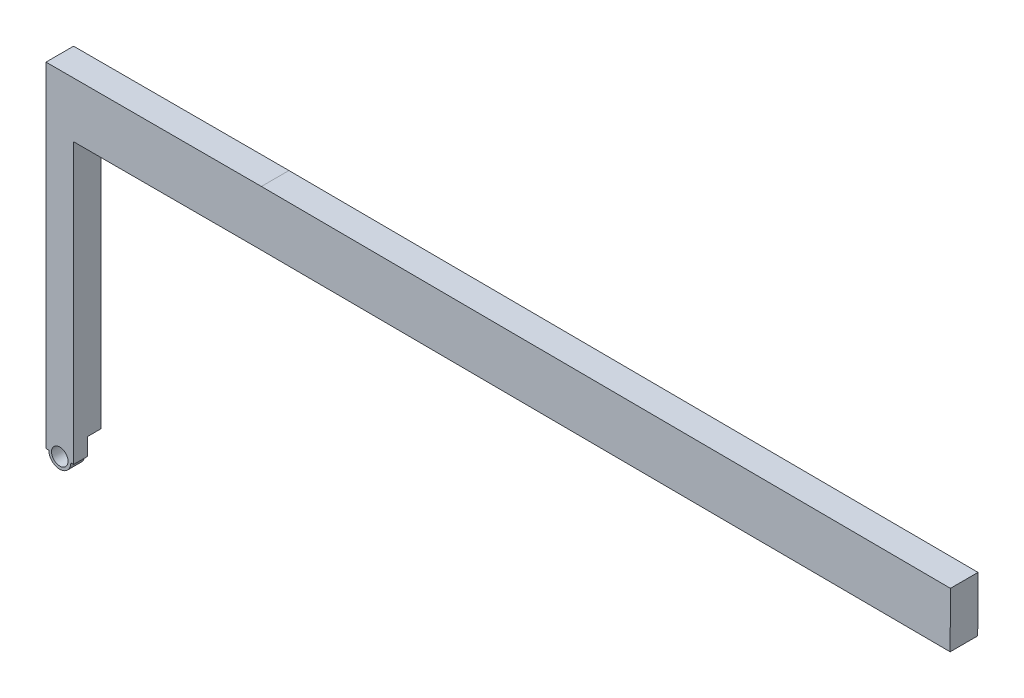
ISO-10303-21;
HEADER;
FILE_DESCRIPTION(('STEP AP214'),'2;1');
FILE_NAME('part.step','',(''),(''),'','','');
FILE_SCHEMA(('AUTOMOTIVE_DESIGN { 1 0 10303 214 1 1 1 1 }'));
ENDSEC;
DATA;
#1=APPLICATION_CONTEXT('core data for automotive mechanical design processes');
#2=APPLICATION_PROTOCOL_DEFINITION('international standard','automotive_design',2000,#1);
#3=PRODUCT_CONTEXT('',#1,'mechanical');
#4=PRODUCT('Part','Part','',(#3));
#5=PRODUCT_RELATED_PRODUCT_CATEGORY('part','',(#4));
#6=PRODUCT_DEFINITION_FORMATION('','',#4);
#7=PRODUCT_DEFINITION_CONTEXT('part definition',#1,'design');
#8=PRODUCT_DEFINITION('design','',#6,#7);
#9=PRODUCT_DEFINITION_SHAPE('','',#8);
#10=(LENGTH_UNIT() NAMED_UNIT(*) SI_UNIT(.MILLI.,.METRE.));
#11=(NAMED_UNIT(*) PLANE_ANGLE_UNIT() SI_UNIT($,.RADIAN.));
#12=(NAMED_UNIT(*) SI_UNIT($,.STERADIAN.) SOLID_ANGLE_UNIT());
#13=UNCERTAINTY_MEASURE_WITH_UNIT(LENGTH_MEASURE(1.E-05),#10,'distance_accuracy_value','');
#14=(GEOMETRIC_REPRESENTATION_CONTEXT(3) GLOBAL_UNCERTAINTY_ASSIGNED_CONTEXT((#13)) GLOBAL_UNIT_ASSIGNED_CONTEXT((#10,
#11,#12)) REPRESENTATION_CONTEXT('',''));
#15=CARTESIAN_POINT('',(0.,0.,0.));
#16=DIRECTION('',(0.,0.,1.));
#17=DIRECTION('',(1.,0.,0.));
#18=AXIS2_PLACEMENT_3D('',#15,#16,#17);
#19=CARTESIAN_POINT('',(0.,15.922114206,1.27));
#20=DIRECTION('',(0.,1.,0.));
#21=DIRECTION('',(0.,0.,1.));
#22=AXIS2_PLACEMENT_3D('',#19,#20,#21);
#23=PLANE('',#22);
#24=DIRECTION('',(1.,0.,0.));
#25=VECTOR('',#24,1.);
#26=CARTESIAN_POINT('',(0.,15.922114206,0.));
#27=LINE('',#26,#25);
#28=CARTESIAN_POINT('',(-1.27,15.922114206,0.));
#29=VERTEX_POINT('',#28);
#30=CARTESIAN_POINT('',(8.64892992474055,15.922114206,0.));
#31=VERTEX_POINT('',#30);
#32=EDGE_CURVE('E190',#29,#31,#27,.T.);
#33=ORIENTED_EDGE('',*,*,#32,.F.);
#34=DIRECTION('',(0.,0.,-1.));
#35=VECTOR('',#34,1.);
#36=CARTESIAN_POINT('',(-1.27,15.922114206,60.10272807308));
#37=LINE('',#36,#35);
#38=CARTESIAN_POINT('',(-1.27,15.922114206,1.27));
#39=VERTEX_POINT('',#38);
#40=EDGE_CURVE('E54',#39,#29,#37,.T.);
#41=ORIENTED_EDGE('',*,*,#40,.F.);
#42=DIRECTION('',(1.,0.,0.));
#43=VECTOR('',#42,1.);
#44=CARTESIAN_POINT('',(0.,15.922114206,1.27));
#45=LINE('',#44,#43);
#46=CARTESIAN_POINT('',(8.64892992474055,15.922114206,1.27));
#47=VERTEX_POINT('',#46);
#48=EDGE_CURVE('E143',#39,#47,#45,.T.);
#49=ORIENTED_EDGE('',*,*,#48,.T.);
#50=DIRECTION('',(0.,0.,-1.));
#51=VECTOR('',#50,1.);
#52=CARTESIAN_POINT('',(8.64892992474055,15.922114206,1.27));
#53=LINE('',#52,#51);
#54=EDGE_CURVE('E203',#47,#31,#53,.T.);
#55=ORIENTED_EDGE('',*,*,#54,.T.);
#56=EDGE_LOOP('',(#33,#41,#49,#55));
#57=FACE_BOUND('',#56,.T.);
#58=ADVANCED_FACE('F31',(#57),#23,.T.);
#59=CARTESIAN_POINT('',(24.5049692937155,13.3012355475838,1.27));
#60=DIRECTION('',(0.,0.,1.));
#61=DIRECTION('',(1.,0.,0.));
#62=AXIS2_PLACEMENT_3D('',#59,#60,#61);
#63=PLANE('',#62);
#64=DIRECTION('',(-1.,0.,0.));
#65=VECTOR('',#64,1.);
#66=CARTESIAN_POINT('',(24.5049692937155,0.508,1.27));
#67=LINE('',#66,#65);
#68=CARTESIAN_POINT('',(0.,0.508,1.27));
#69=VERTEX_POINT('',#68);
#70=CARTESIAN_POINT('',(-0.127,0.508,1.27));
#71=VERTEX_POINT('',#70);
#72=EDGE_CURVE('E232',#69,#71,#67,.T.);
#73=ORIENTED_EDGE('',*,*,#72,.F.);
#74=DIRECTION('',(0.,1.,0.));
#75=VECTOR('',#74,1.);
#76=CARTESIAN_POINT('',(0.,0.,1.27));
#77=LINE('',#76,#75);
#78=CARTESIAN_POINT('',(0.,13.382114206,1.27));
#79=VERTEX_POINT('',#78);
#80=EDGE_CURVE('E173',#69,#79,#77,.T.);
#81=ORIENTED_EDGE('',*,*,#80,.T.);
#82=DIRECTION('',(1.,0.,0.));
#83=VECTOR('',#82,1.);
#84=CARTESIAN_POINT('',(0.,13.382114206,1.27));
#85=LINE('',#84,#83);
#86=CARTESIAN_POINT('',(8.64245458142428,13.382114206,1.27));
#87=VERTEX_POINT('',#86);
#88=EDGE_CURVE('E175',#79,#87,#85,.T.);
#89=ORIENTED_EDGE('',*,*,#88,.T.);
#90=CARTESIAN_POINT('',(8.64245458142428,13.382114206,1.27));
#91=CARTESIAN_POINT('',(19.2174643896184,13.3281951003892,1.27));
#92=CARTESIAN_POINT('',(29.7924741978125,13.2742759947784,1.27));
#93=CARTESIAN_POINT('',(40.3674840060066,13.2203568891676,1.27));
#94=B_SPLINE_CURVE_WITH_KNOTS('',3,(#90,#91,#92,#93),.UNSPECIFIED.,.F.,.F.,(4,4),(0.,1.),.UNSPECIFIED.);
#95=CARTESIAN_POINT('',(40.3674840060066,13.2203568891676,1.27));
#96=VERTEX_POINT('',#95);
#97=EDGE_CURVE('E153',#87,#96,#94,.T.);
#98=ORIENTED_EDGE('',*,*,#97,.T.);
#99=DIRECTION('',(-0.0050986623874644,-0.999987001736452,0.));
#100=VECTOR('',#99,1.);
#101=CARTESIAN_POINT('',(40.3804346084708,15.7603238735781,1.27));
#102=LINE('',#101,#100);
#103=CARTESIAN_POINT('',(40.3804346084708,15.7603238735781,1.27));
#104=VERTEX_POINT('',#103);
#105=EDGE_CURVE('E157',#104,#96,#102,.T.);
#106=ORIENTED_EDGE('',*,*,#105,.F.);
#107=CARTESIAN_POINT('',(8.64892992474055,15.922114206,1.27));
#108=CARTESIAN_POINT('',(40.3804346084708,15.7603238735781,1.27));
#109=B_SPLINE_CURVE_WITH_KNOTS('',1,(#107,#108),.UNSPECIFIED.,.F.,.F.,(2,2),(0.,1.),.UNSPECIFIED.);
#110=EDGE_CURVE('E164',#47,#104,#109,.T.);
#111=ORIENTED_EDGE('',*,*,#110,.F.);
#112=ORIENTED_EDGE('',*,*,#48,.F.);
#113=DIRECTION('',(0.,-1.,0.));
#114=VECTOR('',#113,1.);
#115=CARTESIAN_POINT('',(-1.27,13.3012355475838,1.27));
#116=LINE('',#115,#114);
#117=CARTESIAN_POINT('',(-1.27,0.508,1.27000000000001));
#118=VERTEX_POINT('',#117);
#119=EDGE_CURVE('E134',#39,#118,#116,.T.);
#120=ORIENTED_EDGE('',*,*,#119,.T.);
#121=DIRECTION('',(-1.,0.,0.));
#122=VECTOR('',#121,1.);
#123=CARTESIAN_POINT('',(24.5049692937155,0.508,1.27));
#124=LINE('',#123,#122);
#125=CARTESIAN_POINT('',(-1.143,0.508,1.27));
#126=VERTEX_POINT('',#125);
#127=EDGE_CURVE('E120',#126,#118,#124,.T.);
#128=ORIENTED_EDGE('',*,*,#127,.F.);
#129=CARTESIAN_POINT('',(-0.635,0.508,1.27));
#130=DIRECTION('',(0.,0.,1.));
#131=DIRECTION('',(1.,0.,0.));
#132=AXIS2_PLACEMENT_3D('',#129,#130,#131);
#133=CIRCLE('',#132,0.508);
#134=EDGE_CURVE('E127',#71,#126,#133,.F.);
#135=ORIENTED_EDGE('',*,*,#134,.F.);
#136=EDGE_LOOP('',(#73,#81,#89,#98,#106,#111,#112,#120,#128,#135));
#137=FACE_BOUND('',#136,.T.);
#138=CARTESIAN_POINT('',(-0.635,0.508,1.27));
#139=DIRECTION('',(0.,0.,1.));
#140=DIRECTION('',(1.,0.,0.));
#141=AXIS2_PLACEMENT_3D('',#138,#139,#140);
#142=CIRCLE('',#141,0.381);
#143=CARTESIAN_POINT('',(-0.254,0.508,1.27));
#144=VERTEX_POINT('',#143);
#145=EDGE_CURVE('E149',#144,#144,#142,.T.);
#146=ORIENTED_EDGE('',*,*,#145,.F.);
#147=EDGE_LOOP('',(#146));
#148=FACE_BOUND('',#147,.T.);
#149=ADVANCED_FACE('F140',(#137,#148),#63,.T.);
#150=CARTESIAN_POINT('',(24.5049692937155,13.3012355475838,0.));
#151=DIRECTION('',(0.,0.,1.));
#152=DIRECTION('',(1.,0.,0.));
#153=AXIS2_PLACEMENT_3D('',#150,#151,#152);
#154=PLANE('',#153);
#155=DIRECTION('',(0.,1.,0.));
#156=VECTOR('',#155,1.);
#157=CARTESIAN_POINT('',(0.,0.,0.));
#158=LINE('',#157,#156);
#159=CARTESIAN_POINT('',(0.,1.3011147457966,0.));
#160=VERTEX_POINT('',#159);
#161=CARTESIAN_POINT('',(0.,13.382114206,0.));
#162=VERTEX_POINT('',#161);
#163=EDGE_CURVE('E195',#160,#162,#158,.T.);
#164=ORIENTED_EDGE('',*,*,#163,.F.);
#165=CARTESIAN_POINT('',(-0.635,0.508,0.));
#166=DIRECTION('',(0.,0.,-1.));
#167=DIRECTION('',(-1.,0.,0.));
#168=AXIS2_PLACEMENT_3D('',#165,#166,#167);
#169=CIRCLE('',#168,1.016);
#170=CARTESIAN_POINT('',(-1.27,1.3011147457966,0.));
#171=VERTEX_POINT('',#170);
#172=EDGE_CURVE('E239',#171,#160,#169,.T.);
#173=ORIENTED_EDGE('',*,*,#172,.F.);
#174=DIRECTION('',(0.,-1.,0.));
#175=VECTOR('',#174,1.);
#176=CARTESIAN_POINT('',(-1.27,13.3012355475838,0.));
#177=LINE('',#176,#175);
#178=EDGE_CURVE('E210',#29,#171,#177,.T.);
#179=ORIENTED_EDGE('',*,*,#178,.F.);
#180=ORIENTED_EDGE('',*,*,#32,.T.);
#181=CARTESIAN_POINT('',(8.64892992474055,15.922114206,0.));
#182=CARTESIAN_POINT('',(40.3804346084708,15.7603238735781,0.));
#183=B_SPLINE_CURVE_WITH_KNOTS('',1,(#181,#182),.UNSPECIFIED.,.F.,.F.,(2,2),(0.,1.),.UNSPECIFIED.);
#184=CARTESIAN_POINT('',(40.3804346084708,15.7603238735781,0.));
#185=VERTEX_POINT('',#184);
#186=EDGE_CURVE('E185',#31,#185,#183,.T.);
#187=ORIENTED_EDGE('',*,*,#186,.T.);
#188=DIRECTION('',(-0.0050986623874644,-0.999987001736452,0.));
#189=VECTOR('',#188,1.);
#190=CARTESIAN_POINT('',(40.3804346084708,15.7603238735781,0.));
#191=LINE('',#190,#189);
#192=CARTESIAN_POINT('',(40.3674840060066,13.2203568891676,0.));
#193=VERTEX_POINT('',#192);
#194=EDGE_CURVE('E147',#185,#193,#191,.T.);
#195=ORIENTED_EDGE('',*,*,#194,.T.);
#196=CARTESIAN_POINT('',(8.64245458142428,13.382114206,0.));
#197=CARTESIAN_POINT('',(19.2174643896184,13.3281951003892,0.));
#198=CARTESIAN_POINT('',(29.7924741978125,13.2742759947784,0.));
#199=CARTESIAN_POINT('',(40.3674840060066,13.2203568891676,0.));
#200=B_SPLINE_CURVE_WITH_KNOTS('',3,(#196,#197,#198,#199),.UNSPECIFIED.,.F.,.F.,(4,4),(0.,1.),.UNSPECIFIED.);
#201=CARTESIAN_POINT('',(8.64245458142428,13.382114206,0.));
#202=VERTEX_POINT('',#201);
#203=EDGE_CURVE('E144',#202,#193,#200,.T.);
#204=ORIENTED_EDGE('',*,*,#203,.F.);
#205=DIRECTION('',(1.,0.,0.));
#206=VECTOR('',#205,1.);
#207=CARTESIAN_POINT('',(0.,13.382114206,0.));
#208=LINE('',#207,#206);
#209=EDGE_CURVE('E158',#162,#202,#208,.T.);
#210=ORIENTED_EDGE('',*,*,#209,.F.);
#211=EDGE_LOOP('',(#164,#173,#179,#180,#187,#195,#204,#210));
#212=FACE_BOUND('',#211,.T.);
#213=ADVANCED_FACE('F253',(#212),#154,.F.);
#214=CARTESIAN_POINT('',(8.64245458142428,13.382114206,1.27));
#215=DIRECTION('',(0.00509866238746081,0.999987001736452,0.));
#216=DIRECTION('',(-0.999987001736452,0.00509866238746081,0.));
#217=AXIS2_PLACEMENT_3D('',#214,#215,#216);
#218=PLANE('',#217);
#219=ORIENTED_EDGE('',*,*,#203,.T.);
#220=DIRECTION('',(0.,0.,-1.));
#221=VECTOR('',#220,1.);
#222=CARTESIAN_POINT('',(40.3674840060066,13.2203568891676,1.27));
#223=LINE('',#222,#221);
#224=EDGE_CURVE('E208',#96,#193,#223,.T.);
#225=ORIENTED_EDGE('',*,*,#224,.F.);
#226=ORIENTED_EDGE('',*,*,#97,.F.);
#227=DIRECTION('',(0.,0.,-1.));
#228=VECTOR('',#227,1.);
#229=CARTESIAN_POINT('',(8.64245458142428,13.382114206,1.27));
#230=LINE('',#229,#228);
#231=EDGE_CURVE('E176',#87,#202,#230,.T.);
#232=ORIENTED_EDGE('',*,*,#231,.T.);
#233=EDGE_LOOP('',(#219,#225,#226,#232));
#234=FACE_BOUND('',#233,.T.);
#235=ADVANCED_FACE('F33',(#234),#218,.F.);
#236=CARTESIAN_POINT('',(40.3804346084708,15.7603238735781,1.27));
#237=DIRECTION('',(0.999987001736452,-0.0050986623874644,0.));
#238=DIRECTION('',(0.0050986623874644,0.999987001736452,0.));
#239=AXIS2_PLACEMENT_3D('',#236,#237,#238);
#240=PLANE('',#239);
#241=ORIENTED_EDGE('',*,*,#194,.F.);
#242=DIRECTION('',(0.,0.,-1.));
#243=VECTOR('',#242,1.);
#244=CARTESIAN_POINT('',(40.3804346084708,15.7603238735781,1.27));
#245=LINE('',#244,#243);
#246=EDGE_CURVE('E206',#104,#185,#245,.T.);
#247=ORIENTED_EDGE('',*,*,#246,.F.);
#248=ORIENTED_EDGE('',*,*,#105,.T.);
#249=ORIENTED_EDGE('',*,*,#224,.T.);
#250=EDGE_LOOP('',(#241,#247,#248,#249));
#251=FACE_BOUND('',#250,.T.);
#252=ADVANCED_FACE('F275',(#251),#240,.T.);
#253=CARTESIAN_POINT('',(8.64892992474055,15.922114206,1.27));
#254=DIRECTION('',(0.00509866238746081,0.999987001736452,0.));
#255=DIRECTION('',(-0.999987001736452,0.00509866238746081,0.));
#256=AXIS2_PLACEMENT_3D('',#253,#254,#255);
#257=PLANE('',#256);
#258=ORIENTED_EDGE('',*,*,#186,.F.);
#259=ORIENTED_EDGE('',*,*,#54,.F.);
#260=ORIENTED_EDGE('',*,*,#110,.T.);
#261=ORIENTED_EDGE('',*,*,#246,.T.);
#262=EDGE_LOOP('',(#258,#259,#260,#261));
#263=FACE_BOUND('',#262,.T.);
#264=ADVANCED_FACE('F271',(#263),#257,.T.);
#265=CARTESIAN_POINT('',(0.,0.,1.27));
#266=DIRECTION('',(-1.,0.,0.));
#267=DIRECTION('',(0.,0.,1.));
#268=AXIS2_PLACEMENT_3D('',#265,#266,#267);
#269=PLANE('',#268);
#270=ORIENTED_EDGE('',*,*,#80,.F.);
#271=DIRECTION('',(0.,0.,1.));
#272=VECTOR('',#271,1.);
#273=CARTESIAN_POINT('',(0.,0.508,-55.9189133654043));
#274=LINE('',#273,#272);
#275=CARTESIAN_POINT('',(0.,0.508,0.634999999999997));
#276=VERTEX_POINT('',#275);
#277=EDGE_CURVE('E128',#276,#69,#274,.T.);
#278=ORIENTED_EDGE('',*,*,#277,.F.);
#279=DIRECTION('',(0.,1.,0.));
#280=VECTOR('',#279,1.);
#281=CARTESIAN_POINT('',(0.,0.,0.635));
#282=LINE('',#281,#280);
#283=CARTESIAN_POINT('',(0.,1.3011147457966,0.635));
#284=VERTEX_POINT('',#283);
#285=EDGE_CURVE('E217',#276,#284,#282,.T.);
#286=ORIENTED_EDGE('',*,*,#285,.T.);
#287=DIRECTION('',(0.,0.,-1.));
#288=VECTOR('',#287,1.);
#289=CARTESIAN_POINT('',(0.,1.3011147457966,3.50868195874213));
#290=LINE('',#289,#288);
#291=EDGE_CURVE('E244',#284,#160,#290,.T.);
#292=ORIENTED_EDGE('',*,*,#291,.T.);
#293=ORIENTED_EDGE('',*,*,#163,.T.);
#294=DIRECTION('',(0.,0.,-1.));
#295=VECTOR('',#294,1.);
#296=CARTESIAN_POINT('',(0.,13.382114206,1.27));
#297=LINE('',#296,#295);
#298=EDGE_CURVE('E200',#79,#162,#297,.T.);
#299=ORIENTED_EDGE('',*,*,#298,.F.);
#300=EDGE_LOOP('',(#270,#278,#286,#292,#293,#299));
#301=FACE_BOUND('',#300,.T.);
#302=ADVANCED_FACE('F268',(#301),#269,.F.);
#303=CARTESIAN_POINT('',(0.,13.382114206,1.27));
#304=DIRECTION('',(0.,1.,0.));
#305=DIRECTION('',(0.,0.,1.));
#306=AXIS2_PLACEMENT_3D('',#303,#304,#305);
#307=PLANE('',#306);
#308=ORIENTED_EDGE('',*,*,#209,.T.);
#309=ORIENTED_EDGE('',*,*,#231,.F.);
#310=ORIENTED_EDGE('',*,*,#88,.F.);
#311=ORIENTED_EDGE('',*,*,#298,.T.);
#312=EDGE_LOOP('',(#308,#309,#310,#311));
#313=FACE_BOUND('',#312,.T.);
#314=ADVANCED_FACE('F265',(#313),#307,.F.);
#315=CARTESIAN_POINT('',(-1.27,0.,60.10272807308));
#316=DIRECTION('',(-1.,0.,0.));
#317=DIRECTION('',(0.,0.,1.));
#318=AXIS2_PLACEMENT_3D('',#315,#316,#317);
#319=PLANE('',#318);
#320=DIRECTION('',(0.,0.,1.));
#321=VECTOR('',#320,1.);
#322=CARTESIAN_POINT('',(-1.27,0.508,-55.9189133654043));
#323=LINE('',#322,#321);
#324=CARTESIAN_POINT('',(-1.27,0.508,0.634999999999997));
#325=VERTEX_POINT('',#324);
#326=EDGE_CURVE('E46',#325,#118,#323,.T.);
#327=ORIENTED_EDGE('',*,*,#326,.T.);
#328=ORIENTED_EDGE('',*,*,#119,.F.);
#329=ORIENTED_EDGE('',*,*,#40,.T.);
#330=ORIENTED_EDGE('',*,*,#178,.T.);
#331=DIRECTION('',(0.,0.,-1.));
#332=VECTOR('',#331,1.);
#333=CARTESIAN_POINT('',(-1.27,1.3011147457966,3.50868195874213));
#334=LINE('',#333,#332);
#335=CARTESIAN_POINT('',(-1.27,1.3011147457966,0.635));
#336=VERTEX_POINT('',#335);
#337=EDGE_CURVE('E213',#336,#171,#334,.T.);
#338=ORIENTED_EDGE('',*,*,#337,.F.);
#339=DIRECTION('',(0.,1.,0.));
#340=VECTOR('',#339,1.);
#341=CARTESIAN_POINT('',(-1.27,0.,0.634999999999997));
#342=LINE('',#341,#340);
#343=EDGE_CURVE('E136',#325,#336,#342,.T.);
#344=ORIENTED_EDGE('',*,*,#343,.F.);
#345=EDGE_LOOP('',(#327,#328,#329,#330,#338,#344));
#346=FACE_BOUND('',#345,.T.);
#347=ADVANCED_FACE('F133',(#346),#319,.T.);
#348=CARTESIAN_POINT('',(-0.635,0.508,0.));
#349=DIRECTION('',(0.,0.,1.));
#350=DIRECTION('',(1.,0.,0.));
#351=AXIS2_PLACEMENT_3D('',#348,#349,#350);
#352=CYLINDRICAL_SURFACE('',#351,0.381);
#353=CARTESIAN_POINT('',(-0.635,0.508,0.635));
#354=DIRECTION('',(0.,0.,1.));
#355=DIRECTION('',(1.,0.,0.));
#356=AXIS2_PLACEMENT_3D('',#353,#354,#355);
#357=CIRCLE('',#356,0.381);
#358=CARTESIAN_POINT('',(-0.254,0.508,0.635));
#359=VERTEX_POINT('',#358);
#360=EDGE_CURVE('E214',#359,#359,#357,.F.);
#361=ORIENTED_EDGE('',*,*,#360,.T.);
#362=EDGE_LOOP('',(#361));
#363=FACE_BOUND('',#362,.T.);
#364=ORIENTED_EDGE('',*,*,#145,.T.);
#365=EDGE_LOOP('',(#364));
#366=FACE_BOUND('',#365,.T.);
#367=ADVANCED_FACE('F251',(#363,#366),#352,.F.);
#368=CARTESIAN_POINT('',(0.,0.,0.635));
#369=DIRECTION('',(0.,0.,1.));
#370=DIRECTION('',(1.,0.,0.));
#371=AXIS2_PLACEMENT_3D('',#368,#369,#370);
#372=PLANE('',#371);
#373=ORIENTED_EDGE('',*,*,#285,.F.);
#374=DIRECTION('',(-1.,0.,0.));
#375=VECTOR('',#374,1.);
#376=CARTESIAN_POINT('',(0.,0.508,0.635));
#377=LINE('',#376,#375);
#378=CARTESIAN_POINT('',(-0.127,0.508,0.634999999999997));
#379=VERTEX_POINT('',#378);
#380=EDGE_CURVE('E11',#276,#379,#377,.T.);
#381=ORIENTED_EDGE('',*,*,#380,.T.);
#382=CARTESIAN_POINT('',(-0.635,0.508,0.634999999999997));
#383=DIRECTION('',(0.,0.,1.));
#384=DIRECTION('',(1.,0.,0.));
#385=AXIS2_PLACEMENT_3D('',#382,#383,#384);
#386=CIRCLE('',#385,0.508);
#387=CARTESIAN_POINT('',(-1.143,0.508,0.634999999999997));
#388=VERTEX_POINT('',#387);
#389=EDGE_CURVE('E39',#379,#388,#386,.F.);
#390=ORIENTED_EDGE('',*,*,#389,.T.);
#391=DIRECTION('',(-1.,0.,0.));
#392=VECTOR('',#391,1.);
#393=CARTESIAN_POINT('',(0.,0.508,0.635));
#394=LINE('',#393,#392);
#395=EDGE_CURVE('E219',#388,#325,#394,.T.);
#396=ORIENTED_EDGE('',*,*,#395,.T.);
#397=ORIENTED_EDGE('',*,*,#343,.T.);
#398=CARTESIAN_POINT('',(-0.635,0.508,0.635));
#399=DIRECTION('',(0.,0.,1.));
#400=DIRECTION('',(1.,0.,0.));
#401=AXIS2_PLACEMENT_3D('',#398,#399,#400);
#402=CIRCLE('',#401,1.016);
#403=EDGE_CURVE('E241',#336,#284,#402,.F.);
#404=ORIENTED_EDGE('',*,*,#403,.T.);
#405=EDGE_LOOP('',(#373,#381,#390,#396,#397,#404));
#406=FACE_BOUND('',#405,.T.);
#407=ORIENTED_EDGE('',*,*,#360,.F.);
#408=EDGE_LOOP('',(#407));
#409=FACE_BOUND('',#408,.T.);
#410=ADVANCED_FACE('F223',(#406,#409),#372,.F.);
#411=CARTESIAN_POINT('',(-0.635,0.508,3.50868195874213));
#412=DIRECTION('',(0.,0.,-1.));
#413=DIRECTION('',(-1.,0.,0.));
#414=AXIS2_PLACEMENT_3D('',#411,#412,#413);
#415=CYLINDRICAL_SURFACE('',#414,1.016);
#416=ORIENTED_EDGE('',*,*,#403,.F.);
#417=ORIENTED_EDGE('',*,*,#337,.T.);
#418=ORIENTED_EDGE('',*,*,#172,.T.);
#419=ORIENTED_EDGE('',*,*,#291,.F.);
#420=EDGE_LOOP('',(#416,#417,#418,#419));
#421=FACE_BOUND('',#420,.T.);
#422=ADVANCED_FACE('F300',(#421),#415,.F.);
#423=CARTESIAN_POINT('',(-0.127,0.508,-55.9189133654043));
#424=DIRECTION('',(0.,1.,0.));
#425=DIRECTION('',(0.,0.,1.));
#426=AXIS2_PLACEMENT_3D('',#423,#424,#425);
#427=PLANE('',#426);
#428=ORIENTED_EDGE('',*,*,#277,.T.);
#429=ORIENTED_EDGE('',*,*,#72,.T.);
#430=DIRECTION('',(0.,0.,1.));
#431=VECTOR('',#430,1.);
#432=CARTESIAN_POINT('',(-0.127,0.508,-55.9189133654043));
#433=LINE('',#432,#431);
#434=EDGE_CURVE('E137',#379,#71,#433,.T.);
#435=ORIENTED_EDGE('',*,*,#434,.F.);
#436=ORIENTED_EDGE('',*,*,#380,.F.);
#437=EDGE_LOOP('',(#428,#429,#435,#436));
#438=FACE_BOUND('',#437,.T.);
#439=ADVANCED_FACE('F230',(#438),#427,.F.);
#440=CARTESIAN_POINT('',(-0.635,0.508,-55.9189133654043));
#441=DIRECTION('',(0.,0.,1.));
#442=DIRECTION('',(1.,0.,0.));
#443=AXIS2_PLACEMENT_3D('',#440,#441,#442);
#444=CYLINDRICAL_SURFACE('',#443,0.508);
#445=ORIENTED_EDGE('',*,*,#434,.T.);
#446=ORIENTED_EDGE('',*,*,#134,.T.);
#447=DIRECTION('',(0.,0.,1.));
#448=VECTOR('',#447,1.);
#449=CARTESIAN_POINT('',(-1.143,0.508,-55.9189133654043));
#450=LINE('',#449,#448);
#451=EDGE_CURVE('E123',#388,#126,#450,.T.);
#452=ORIENTED_EDGE('',*,*,#451,.F.);
#453=ORIENTED_EDGE('',*,*,#389,.F.);
#454=EDGE_LOOP('',(#445,#446,#452,#453));
#455=FACE_BOUND('',#454,.T.);
#456=ADVANCED_FACE('F228',(#455),#444,.T.);
#457=CARTESIAN_POINT('',(-1.143,0.508,-55.9189133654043));
#458=DIRECTION('',(0.,1.,0.));
#459=DIRECTION('',(0.,0.,1.));
#460=AXIS2_PLACEMENT_3D('',#457,#458,#459);
#461=PLANE('',#460);
#462=ORIENTED_EDGE('',*,*,#451,.T.);
#463=ORIENTED_EDGE('',*,*,#127,.T.);
#464=ORIENTED_EDGE('',*,*,#326,.F.);
#465=ORIENTED_EDGE('',*,*,#395,.F.);
#466=EDGE_LOOP('',(#462,#463,#464,#465));
#467=FACE_BOUND('',#466,.T.);
#468=ADVANCED_FACE('F121',(#467),#461,.F.);
#469=CLOSED_SHELL('',(#58,#149,#213,#235,#252,#264,#302,#314,#347,#367,#410,#422,#439,#456,#468));
#470=MANIFOLD_SOLID_BREP('B2',#469);
#471=ADVANCED_BREP_SHAPE_REPRESENTATION('',(#18,#470),#14);
#472=SHAPE_DEFINITION_REPRESENTATION(#9,#471);
ENDSEC;
END-ISO-10303-21;
